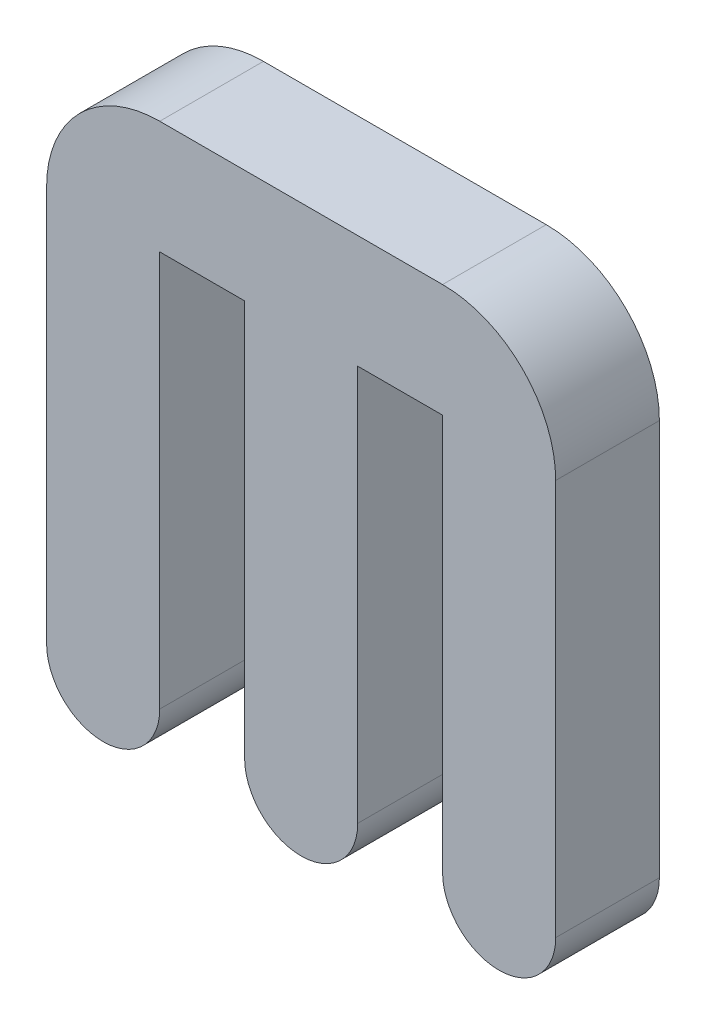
ISO-10303-21;
HEADER;
FILE_DESCRIPTION(('STEP AP214'),'2;1');
FILE_NAME('part.step','',(''),(''),'','','');
FILE_SCHEMA(('AUTOMOTIVE_DESIGN { 1 0 10303 214 1 1 1 1 }'));
ENDSEC;
DATA;
#1=APPLICATION_CONTEXT('core data for automotive mechanical design processes');
#2=APPLICATION_PROTOCOL_DEFINITION('international standard','automotive_design',2000,#1);
#3=PRODUCT_CONTEXT('',#1,'mechanical');
#4=PRODUCT('Part','Part','',(#3));
#5=PRODUCT_RELATED_PRODUCT_CATEGORY('part','',(#4));
#6=PRODUCT_DEFINITION_FORMATION('','',#4);
#7=PRODUCT_DEFINITION_CONTEXT('part definition',#1,'design');
#8=PRODUCT_DEFINITION('design','',#6,#7);
#9=PRODUCT_DEFINITION_SHAPE('','',#8);
#10=(LENGTH_UNIT() NAMED_UNIT(*) SI_UNIT(.MILLI.,.METRE.));
#11=(NAMED_UNIT(*) PLANE_ANGLE_UNIT() SI_UNIT($,.RADIAN.));
#12=(NAMED_UNIT(*) SI_UNIT($,.STERADIAN.) SOLID_ANGLE_UNIT());
#13=UNCERTAINTY_MEASURE_WITH_UNIT(LENGTH_MEASURE(1.E-05),#10,'distance_accuracy_value','');
#14=(GEOMETRIC_REPRESENTATION_CONTEXT(3) GLOBAL_UNCERTAINTY_ASSIGNED_CONTEXT((#13)) GLOBAL_UNIT_ASSIGNED_CONTEXT((#10,
#11,#12)) REPRESENTATION_CONTEXT('',''));
#15=CARTESIAN_POINT('',(0.,0.,0.));
#16=DIRECTION('',(0.,0.,1.));
#17=DIRECTION('',(1.,0.,0.));
#18=AXIS2_PLACEMENT_3D('',#15,#16,#17);
#19=CARTESIAN_POINT('',(-4.0909085,-6.45454400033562,3.));
#20=DIRECTION('',(-1.,0.,0.));
#21=DIRECTION('',(0.,-1.,0.));
#22=AXIS2_PLACEMENT_3D('',#19,#20,#21);
#23=PLANE('',#22);
#24=DIRECTION('',(0.,1.,0.));
#25=VECTOR('',#24,1.);
#26=CARTESIAN_POINT('',(-4.0909085,-6.45454400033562,0.));
#27=LINE('',#26,#25);
#28=CARTESIAN_POINT('',(-4.0909085,-6.45454400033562,0.));
#29=VERTEX_POINT('',#28);
#30=CARTESIAN_POINT('',(-4.0909085,4.999999,0.));
#31=VERTEX_POINT('',#30);
#32=EDGE_CURVE('E203',#29,#31,#27,.T.);
#33=ORIENTED_EDGE('',*,*,#32,.T.);
#34=DIRECTION('',(0.,0.,-1.));
#35=VECTOR('',#34,1.);
#36=CARTESIAN_POINT('',(-4.0909085,4.999999,3.));
#37=LINE('',#36,#35);
#38=CARTESIAN_POINT('',(-4.0909085,4.999999,3.));
#39=VERTEX_POINT('',#38);
#40=EDGE_CURVE('E11',#39,#31,#37,.T.);
#41=ORIENTED_EDGE('',*,*,#40,.F.);
#42=DIRECTION('',(0.,1.,0.));
#43=VECTOR('',#42,1.);
#44=CARTESIAN_POINT('',(-4.0909085,-6.45454400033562,3.));
#45=LINE('',#44,#43);
#46=CARTESIAN_POINT('',(-4.0909085,-6.45454400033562,3.));
#47=VERTEX_POINT('',#46);
#48=EDGE_CURVE('E242',#47,#39,#45,.T.);
#49=ORIENTED_EDGE('',*,*,#48,.F.);
#50=DIRECTION('',(0.,0.,-1.));
#51=VECTOR('',#50,1.);
#52=CARTESIAN_POINT('',(-4.0909085,-6.45454400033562,3.));
#53=LINE('',#52,#51);
#54=EDGE_CURVE('E199',#47,#29,#53,.T.);
#55=ORIENTED_EDGE('',*,*,#54,.T.);
#56=EDGE_LOOP('',(#33,#41,#49,#55));
#57=FACE_BOUND('',#56,.T.);
#58=ADVANCED_FACE('F40',(#57),#23,.F.);
#59=CARTESIAN_POINT('',(-4.0909085,4.999999,3.));
#60=DIRECTION('',(0.,1.,0.));
#61=DIRECTION('',(-1.,0.,0.));
#62=AXIS2_PLACEMENT_3D('',#59,#60,#61);
#63=PLANE('',#62);
#64=DIRECTION('',(1.,0.,0.));
#65=VECTOR('',#64,1.);
#66=CARTESIAN_POINT('',(-4.0909085,4.999999,0.));
#67=LINE('',#66,#65);
#68=CARTESIAN_POINT('',(-1.6363635,4.999999,0.));
#69=VERTEX_POINT('',#68);
#70=EDGE_CURVE('E207',#31,#69,#67,.T.);
#71=ORIENTED_EDGE('',*,*,#70,.T.);
#72=DIRECTION('',(0.,0.,-1.));
#73=VECTOR('',#72,1.);
#74=CARTESIAN_POINT('',(-1.6363635,4.999999,3.));
#75=LINE('',#74,#73);
#76=CARTESIAN_POINT('',(-1.6363635,4.999999,3.));
#77=VERTEX_POINT('',#76);
#78=EDGE_CURVE('E49',#77,#69,#75,.T.);
#79=ORIENTED_EDGE('',*,*,#78,.F.);
#80=DIRECTION('',(1.,0.,0.));
#81=VECTOR('',#80,1.);
#82=CARTESIAN_POINT('',(-4.0909085,4.999999,3.));
#83=LINE('',#82,#81);
#84=EDGE_CURVE('E136',#39,#77,#83,.T.);
#85=ORIENTED_EDGE('',*,*,#84,.F.);
#86=ORIENTED_EDGE('',*,*,#40,.T.);
#87=EDGE_LOOP('',(#71,#79,#85,#86));
#88=FACE_BOUND('',#87,.T.);
#89=ADVANCED_FACE('F332',(#88),#63,.F.);
#90=CARTESIAN_POINT('',(-1.6363635,4.999999,3.));
#91=DIRECTION('',(1.,0.,0.));
#92=DIRECTION('',(0.,1.,0.));
#93=AXIS2_PLACEMENT_3D('',#90,#91,#92);
#94=PLANE('',#93);
#95=DIRECTION('',(0.,-1.,0.));
#96=VECTOR('',#95,1.);
#97=CARTESIAN_POINT('',(-1.6363635,4.999999,0.));
#98=LINE('',#97,#96);
#99=CARTESIAN_POINT('',(-1.6363635,-6.454543,0.));
#100=VERTEX_POINT('',#99);
#101=EDGE_CURVE('E210',#69,#100,#98,.T.);
#102=ORIENTED_EDGE('',*,*,#101,.T.);
#103=DIRECTION('',(0.,0.,-1.));
#104=VECTOR('',#103,1.);
#105=CARTESIAN_POINT('',(-1.6363635,-6.454543,3.));
#106=LINE('',#105,#104);
#107=CARTESIAN_POINT('',(-1.6363635,-6.454543,3.));
#108=VERTEX_POINT('',#107);
#109=EDGE_CURVE('E276',#108,#100,#106,.T.);
#110=ORIENTED_EDGE('',*,*,#109,.F.);
#111=DIRECTION('',(0.,-1.,0.));
#112=VECTOR('',#111,1.);
#113=CARTESIAN_POINT('',(-1.6363635,4.999999,3.));
#114=LINE('',#113,#112);
#115=EDGE_CURVE('E287',#77,#108,#114,.T.);
#116=ORIENTED_EDGE('',*,*,#115,.F.);
#117=ORIENTED_EDGE('',*,*,#78,.T.);
#118=EDGE_LOOP('',(#102,#110,#116,#117));
#119=FACE_BOUND('',#118,.T.);
#120=ADVANCED_FACE('F285',(#119),#94,.F.);
#121=CARTESIAN_POINT('',(0.,-6.454543,3.));
#122=DIRECTION('',(0.,0.,-1.));
#123=DIRECTION('',(-1.,0.,0.));
#124=AXIS2_PLACEMENT_3D('',#121,#122,#123);
#125=CYLINDRICAL_SURFACE('',#124,1.6363635);
#126=CARTESIAN_POINT('',(0.,-6.454543,0.));
#127=DIRECTION('',(0.,0.,1.));
#128=DIRECTION('',(1.,0.,0.));
#129=AXIS2_PLACEMENT_3D('',#126,#127,#128);
#130=CIRCLE('',#129,1.6363635);
#131=CARTESIAN_POINT('',(1.6363635,-6.45454300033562,0.));
#132=VERTEX_POINT('',#131);
#133=EDGE_CURVE('E213',#100,#132,#130,.T.);
#134=ORIENTED_EDGE('',*,*,#133,.T.);
#135=DIRECTION('',(0.,0.,-1.));
#136=VECTOR('',#135,1.);
#137=CARTESIAN_POINT('',(1.6363635,-6.45454300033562,3.));
#138=LINE('',#137,#136);
#139=CARTESIAN_POINT('',(1.6363635,-6.45454300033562,3.));
#140=VERTEX_POINT('',#139);
#141=EDGE_CURVE('E272',#140,#132,#138,.T.);
#142=ORIENTED_EDGE('',*,*,#141,.F.);
#143=CARTESIAN_POINT('',(0.,-6.454543,3.));
#144=DIRECTION('',(0.,0.,1.));
#145=DIRECTION('',(1.,0.,0.));
#146=AXIS2_PLACEMENT_3D('',#143,#144,#145);
#147=CIRCLE('',#146,1.6363635);
#148=EDGE_CURVE('E306',#108,#140,#147,.T.);
#149=ORIENTED_EDGE('',*,*,#148,.F.);
#150=ORIENTED_EDGE('',*,*,#109,.T.);
#151=EDGE_LOOP('',(#134,#142,#149,#150));
#152=FACE_BOUND('',#151,.T.);
#153=ADVANCED_FACE('F296',(#152),#125,.T.);
#154=CARTESIAN_POINT('',(1.6363635,-6.45454300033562,3.));
#155=DIRECTION('',(-1.,0.,0.));
#156=DIRECTION('',(0.,-1.,0.));
#157=AXIS2_PLACEMENT_3D('',#154,#155,#156);
#158=PLANE('',#157);
#159=DIRECTION('',(0.,1.,0.));
#160=VECTOR('',#159,1.);
#161=CARTESIAN_POINT('',(1.6363635,-6.45454300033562,0.));
#162=LINE('',#161,#160);
#163=CARTESIAN_POINT('',(1.6363635,4.999999,0.));
#164=VERTEX_POINT('',#163);
#165=EDGE_CURVE('E216',#132,#164,#162,.T.);
#166=ORIENTED_EDGE('',*,*,#165,.T.);
#167=DIRECTION('',(0.,0.,-1.));
#168=VECTOR('',#167,1.);
#169=CARTESIAN_POINT('',(1.6363635,4.999999,3.));
#170=LINE('',#169,#168);
#171=CARTESIAN_POINT('',(1.6363635,4.999999,3.));
#172=VERTEX_POINT('',#171);
#173=EDGE_CURVE('E268',#172,#164,#170,.T.);
#174=ORIENTED_EDGE('',*,*,#173,.F.);
#175=DIRECTION('',(0.,1.,0.));
#176=VECTOR('',#175,1.);
#177=CARTESIAN_POINT('',(1.6363635,-6.45454300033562,3.));
#178=LINE('',#177,#176);
#179=EDGE_CURVE('E302',#140,#172,#178,.T.);
#180=ORIENTED_EDGE('',*,*,#179,.F.);
#181=ORIENTED_EDGE('',*,*,#141,.T.);
#182=EDGE_LOOP('',(#166,#174,#180,#181));
#183=FACE_BOUND('',#182,.T.);
#184=ADVANCED_FACE('F300',(#183),#158,.F.);
#185=CARTESIAN_POINT('',(1.6363635,4.999999,3.));
#186=DIRECTION('',(0.,1.,0.));
#187=DIRECTION('',(-1.,0.,0.));
#188=AXIS2_PLACEMENT_3D('',#185,#186,#187);
#189=PLANE('',#188);
#190=DIRECTION('',(1.,0.,0.));
#191=VECTOR('',#190,1.);
#192=CARTESIAN_POINT('',(1.6363635,4.999999,0.));
#193=LINE('',#192,#191);
#194=CARTESIAN_POINT('',(4.0909095,4.999999,0.));
#195=VERTEX_POINT('',#194);
#196=EDGE_CURVE('E219',#164,#195,#193,.T.);
#197=ORIENTED_EDGE('',*,*,#196,.T.);
#198=DIRECTION('',(0.,0.,-1.));
#199=VECTOR('',#198,1.);
#200=CARTESIAN_POINT('',(4.0909095,4.999999,3.));
#201=LINE('',#200,#199);
#202=CARTESIAN_POINT('',(4.0909095,4.999999,3.));
#203=VERTEX_POINT('',#202);
#204=EDGE_CURVE('E264',#203,#195,#201,.T.);
#205=ORIENTED_EDGE('',*,*,#204,.F.);
#206=DIRECTION('',(1.,0.,0.));
#207=VECTOR('',#206,1.);
#208=CARTESIAN_POINT('',(1.6363635,4.999999,3.));
#209=LINE('',#208,#207);
#210=EDGE_CURVE('E305',#172,#203,#209,.T.);
#211=ORIENTED_EDGE('',*,*,#210,.F.);
#212=ORIENTED_EDGE('',*,*,#173,.T.);
#213=EDGE_LOOP('',(#197,#205,#211,#212));
#214=FACE_BOUND('',#213,.T.);
#215=ADVANCED_FACE('F344',(#214),#189,.F.);
#216=CARTESIAN_POINT('',(4.0909095,4.999999,3.));
#217=DIRECTION('',(1.,0.,0.));
#218=DIRECTION('',(0.,0.,-1.));
#219=AXIS2_PLACEMENT_3D('',#216,#217,#218);
#220=PLANE('',#219);
#221=DIRECTION('',(0.,-1.,0.));
#222=VECTOR('',#221,1.);
#223=CARTESIAN_POINT('',(4.0909095,4.999999,0.));
#224=LINE('',#223,#222);
#225=CARTESIAN_POINT('',(4.0909095,-6.454547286,0.));
#226=VERTEX_POINT('',#225);
#227=EDGE_CURVE('E222',#195,#226,#224,.T.);
#228=ORIENTED_EDGE('',*,*,#227,.T.);
#229=DIRECTION('',(0.,0.,-1.));
#230=VECTOR('',#229,1.);
#231=CARTESIAN_POINT('',(4.0909095,-6.454547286,3.));
#232=LINE('',#231,#230);
#233=CARTESIAN_POINT('',(4.0909095,-6.454547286,3.));
#234=VERTEX_POINT('',#233);
#235=EDGE_CURVE('E260',#234,#226,#232,.T.);
#236=ORIENTED_EDGE('',*,*,#235,.F.);
#237=DIRECTION('',(0.,-1.,0.));
#238=VECTOR('',#237,1.);
#239=CARTESIAN_POINT('',(4.0909095,4.999999,3.));
#240=LINE('',#239,#238);
#241=EDGE_CURVE('E310',#203,#234,#240,.T.);
#242=ORIENTED_EDGE('',*,*,#241,.F.);
#243=ORIENTED_EDGE('',*,*,#204,.T.);
#244=EDGE_LOOP('',(#228,#236,#242,#243));
#245=FACE_BOUND('',#244,.T.);
#246=ADVANCED_FACE('F347',(#245),#220,.F.);
#247=CARTESIAN_POINT('',(5.727273,-6.454547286,3.));
#248=DIRECTION('',(0.,0.,-1.));
#249=DIRECTION('',(-1.,0.,0.));
#250=AXIS2_PLACEMENT_3D('',#247,#248,#249);
#251=CYLINDRICAL_SURFACE('',#250,1.6363635);
#252=CARTESIAN_POINT('',(5.727273,-6.454547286,0.));
#253=DIRECTION('',(0.,0.,1.));
#254=DIRECTION('',(1.,0.,0.));
#255=AXIS2_PLACEMENT_3D('',#252,#253,#254);
#256=CIRCLE('',#255,1.6363635);
#257=CARTESIAN_POINT('',(7.3636365,-6.45454728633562,0.));
#258=VERTEX_POINT('',#257);
#259=EDGE_CURVE('E225',#226,#258,#256,.T.);
#260=ORIENTED_EDGE('',*,*,#259,.T.);
#261=DIRECTION('',(0.,0.,-1.));
#262=VECTOR('',#261,1.);
#263=CARTESIAN_POINT('',(7.3636365,-6.45454728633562,3.));
#264=LINE('',#263,#262);
#265=CARTESIAN_POINT('',(7.3636365,-6.45454728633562,3.));
#266=VERTEX_POINT('',#265);
#267=EDGE_CURVE('E256',#266,#258,#264,.T.);
#268=ORIENTED_EDGE('',*,*,#267,.F.);
#269=CARTESIAN_POINT('',(5.727273,-6.454547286,3.));
#270=DIRECTION('',(0.,0.,1.));
#271=DIRECTION('',(1.,0.,0.));
#272=AXIS2_PLACEMENT_3D('',#269,#270,#271);
#273=CIRCLE('',#272,1.6363635);
#274=EDGE_CURVE('E317',#234,#266,#273,.T.);
#275=ORIENTED_EDGE('',*,*,#274,.F.);
#276=ORIENTED_EDGE('',*,*,#235,.T.);
#277=EDGE_LOOP('',(#260,#268,#275,#276));
#278=FACE_BOUND('',#277,.T.);
#279=ADVANCED_FACE('F351',(#278),#251,.T.);
#280=CARTESIAN_POINT('',(7.3636365,-6.45454728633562,3.));
#281=DIRECTION('',(-1.,0.,0.));
#282=DIRECTION('',(0.,-1.,0.));
#283=AXIS2_PLACEMENT_3D('',#280,#281,#282);
#284=PLANE('',#283);
#285=DIRECTION('',(0.,1.,0.));
#286=VECTOR('',#285,1.);
#287=CARTESIAN_POINT('',(7.3636365,-6.45454728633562,0.));
#288=LINE('',#287,#286);
#289=CARTESIAN_POINT('',(7.3636365,4.99999899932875,0.));
#290=VERTEX_POINT('',#289);
#291=EDGE_CURVE('E228',#258,#290,#288,.T.);
#292=ORIENTED_EDGE('',*,*,#291,.T.);
#293=DIRECTION('',(0.,0.,-1.));
#294=VECTOR('',#293,1.);
#295=CARTESIAN_POINT('',(7.3636365,4.99999899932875,3.));
#296=LINE('',#295,#294);
#297=CARTESIAN_POINT('',(7.3636365,4.99999899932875,3.));
#298=VERTEX_POINT('',#297);
#299=EDGE_CURVE('E252',#298,#290,#296,.T.);
#300=ORIENTED_EDGE('',*,*,#299,.F.);
#301=DIRECTION('',(0.,1.,0.));
#302=VECTOR('',#301,1.);
#303=CARTESIAN_POINT('',(7.3636365,-6.45454728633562,3.));
#304=LINE('',#303,#302);
#305=EDGE_CURVE('E320',#266,#298,#304,.T.);
#306=ORIENTED_EDGE('',*,*,#305,.F.);
#307=ORIENTED_EDGE('',*,*,#267,.T.);
#308=EDGE_LOOP('',(#292,#300,#306,#307));
#309=FACE_BOUND('',#308,.T.);
#310=ADVANCED_FACE('F355',(#309),#284,.F.);
#311=CARTESIAN_POINT('',(4.0909095,4.999999,3.));
#312=DIRECTION('',(0.,0.,-1.));
#313=DIRECTION('',(-1.,0.,0.));
#314=AXIS2_PLACEMENT_3D('',#311,#312,#313);
#315=CYLINDRICAL_SURFACE('',#314,3.272727);
#316=CARTESIAN_POINT('',(4.0909095,4.999999,0.));
#317=DIRECTION('',(0.,0.,1.));
#318=DIRECTION('',(1.,0.,0.));
#319=AXIS2_PLACEMENT_3D('',#316,#317,#318);
#320=CIRCLE('',#319,3.272727);
#321=CARTESIAN_POINT('',(4.09090950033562,8.272726,0.));
#322=VERTEX_POINT('',#321);
#323=EDGE_CURVE('E231',#290,#322,#320,.T.);
#324=ORIENTED_EDGE('',*,*,#323,.T.);
#325=DIRECTION('',(0.,0.,-1.));
#326=VECTOR('',#325,1.);
#327=CARTESIAN_POINT('',(4.09090950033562,8.272726,3.));
#328=LINE('',#327,#326);
#329=CARTESIAN_POINT('',(4.09090950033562,8.272726,3.));
#330=VERTEX_POINT('',#329);
#331=EDGE_CURVE('E249',#330,#322,#328,.T.);
#332=ORIENTED_EDGE('',*,*,#331,.F.);
#333=CARTESIAN_POINT('',(4.0909095,4.999999,3.));
#334=DIRECTION('',(0.,0.,1.));
#335=DIRECTION('',(1.,0.,0.));
#336=AXIS2_PLACEMENT_3D('',#333,#334,#335);
#337=CIRCLE('',#336,3.272727);
#338=EDGE_CURVE('E323',#298,#330,#337,.T.);
#339=ORIENTED_EDGE('',*,*,#338,.F.);
#340=ORIENTED_EDGE('',*,*,#299,.T.);
#341=EDGE_LOOP('',(#324,#332,#339,#340));
#342=FACE_BOUND('',#341,.T.);
#343=ADVANCED_FACE('F359',(#342),#315,.T.);
#344=CARTESIAN_POINT('',(4.09090950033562,8.272726,3.));
#345=DIRECTION('',(0.,-1.,0.));
#346=DIRECTION('',(0.,0.,-1.));
#347=AXIS2_PLACEMENT_3D('',#344,#345,#346);
#348=PLANE('',#347);
#349=DIRECTION('',(-1.,0.,0.));
#350=VECTOR('',#349,1.);
#351=CARTESIAN_POINT('',(4.09090950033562,8.272726,0.));
#352=LINE('',#351,#350);
#353=CARTESIAN_POINT('',(-4.0909085,8.272726,0.));
#354=VERTEX_POINT('',#353);
#355=EDGE_CURVE('E234',#322,#354,#352,.T.);
#356=ORIENTED_EDGE('',*,*,#355,.T.);
#357=DIRECTION('',(0.,0.,-1.));
#358=VECTOR('',#357,1.);
#359=CARTESIAN_POINT('',(-4.0909085,8.272726,3.));
#360=LINE('',#359,#358);
#361=CARTESIAN_POINT('',(-4.0909085,8.272726,3.));
#362=VERTEX_POINT('',#361);
#363=EDGE_CURVE('E191',#362,#354,#360,.T.);
#364=ORIENTED_EDGE('',*,*,#363,.F.);
#365=DIRECTION('',(-1.,0.,0.));
#366=VECTOR('',#365,1.);
#367=CARTESIAN_POINT('',(4.09090950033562,8.272726,3.));
#368=LINE('',#367,#366);
#369=EDGE_CURVE('E180',#330,#362,#368,.T.);
#370=ORIENTED_EDGE('',*,*,#369,.F.);
#371=ORIENTED_EDGE('',*,*,#331,.T.);
#372=EDGE_LOOP('',(#356,#364,#370,#371));
#373=FACE_BOUND('',#372,.T.);
#374=ADVANCED_FACE('F363',(#373),#348,.F.);
#375=CARTESIAN_POINT('',(-4.0909085,4.999999,3.));
#376=DIRECTION('',(0.,0.,-1.));
#377=DIRECTION('',(-1.,0.,0.));
#378=AXIS2_PLACEMENT_3D('',#375,#376,#377);
#379=CYLINDRICAL_SURFACE('',#378,3.272727);
#380=CARTESIAN_POINT('',(-4.0909085,4.999999,0.));
#381=DIRECTION('',(0.,0.,1.));
#382=DIRECTION('',(1.,0.,0.));
#383=AXIS2_PLACEMENT_3D('',#380,#381,#382);
#384=CIRCLE('',#383,3.272727);
#385=CARTESIAN_POINT('',(-7.3636355,4.999999,0.));
#386=VERTEX_POINT('',#385);
#387=EDGE_CURVE('E189',#354,#386,#384,.T.);
#388=ORIENTED_EDGE('',*,*,#387,.T.);
#389=DIRECTION('',(0.,0.,-1.));
#390=VECTOR('',#389,1.);
#391=CARTESIAN_POINT('',(-7.3636355,4.999999,3.));
#392=LINE('',#391,#390);
#393=CARTESIAN_POINT('',(-7.3636355,4.999999,3.));
#394=VERTEX_POINT('',#393);
#395=EDGE_CURVE('E186',#394,#386,#392,.T.);
#396=ORIENTED_EDGE('',*,*,#395,.F.);
#397=CARTESIAN_POINT('',(-4.0909085,4.999999,3.));
#398=DIRECTION('',(0.,0.,1.));
#399=DIRECTION('',(1.,0.,0.));
#400=AXIS2_PLACEMENT_3D('',#397,#398,#399);
#401=CIRCLE('',#400,3.272727);
#402=EDGE_CURVE('E174',#362,#394,#401,.T.);
#403=ORIENTED_EDGE('',*,*,#402,.F.);
#404=ORIENTED_EDGE('',*,*,#363,.T.);
#405=EDGE_LOOP('',(#388,#396,#403,#404));
#406=FACE_BOUND('',#405,.T.);
#407=ADVANCED_FACE('F187',(#406),#379,.T.);
#408=CARTESIAN_POINT('',(-7.3636355,4.999999,3.));
#409=DIRECTION('',(1.,0.,0.));
#410=DIRECTION('',(0.,0.,-1.));
#411=AXIS2_PLACEMENT_3D('',#408,#409,#410);
#412=PLANE('',#411);
#413=DIRECTION('',(0.,-1.,0.));
#414=VECTOR('',#413,1.);
#415=CARTESIAN_POINT('',(-7.3636355,4.999999,0.));
#416=LINE('',#415,#414);
#417=CARTESIAN_POINT('',(-7.3636355,-6.454544,0.));
#418=VERTEX_POINT('',#417);
#419=EDGE_CURVE('E119',#386,#418,#416,.T.);
#420=ORIENTED_EDGE('',*,*,#419,.T.);
#421=DIRECTION('',(0.,0.,-1.));
#422=VECTOR('',#421,1.);
#423=CARTESIAN_POINT('',(-7.3636355,-6.454544,3.));
#424=LINE('',#423,#422);
#425=CARTESIAN_POINT('',(-7.3636355,-6.454544,3.));
#426=VERTEX_POINT('',#425);
#427=EDGE_CURVE('E192',#426,#418,#424,.T.);
#428=ORIENTED_EDGE('',*,*,#427,.F.);
#429=DIRECTION('',(0.,-1.,0.));
#430=VECTOR('',#429,1.);
#431=CARTESIAN_POINT('',(-7.3636355,4.999999,3.));
#432=LINE('',#431,#430);
#433=EDGE_CURVE('E178',#394,#426,#432,.T.);
#434=ORIENTED_EDGE('',*,*,#433,.F.);
#435=ORIENTED_EDGE('',*,*,#395,.T.);
#436=EDGE_LOOP('',(#420,#428,#434,#435));
#437=FACE_BOUND('',#436,.T.);
#438=ADVANCED_FACE('F194',(#437),#412,.F.);
#439=CARTESIAN_POINT('',(-5.727272,-6.454544,3.));
#440=DIRECTION('',(0.,0.,-1.));
#441=DIRECTION('',(-1.,0.,0.));
#442=AXIS2_PLACEMENT_3D('',#439,#440,#441);
#443=CYLINDRICAL_SURFACE('',#442,1.6363635);
#444=CARTESIAN_POINT('',(-5.727272,-6.454544,0.));
#445=DIRECTION('',(0.,0.,1.));
#446=DIRECTION('',(1.,0.,0.));
#447=AXIS2_PLACEMENT_3D('',#444,#445,#446);
#448=CIRCLE('',#447,1.6363635);
#449=EDGE_CURVE('E125',#418,#29,#448,.T.);
#450=ORIENTED_EDGE('',*,*,#449,.T.);
#451=ORIENTED_EDGE('',*,*,#54,.F.);
#452=CARTESIAN_POINT('',(-5.727272,-6.454544,3.));
#453=DIRECTION('',(0.,0.,1.));
#454=DIRECTION('',(1.,0.,0.));
#455=AXIS2_PLACEMENT_3D('',#452,#453,#454);
#456=CIRCLE('',#455,1.6363635);
#457=EDGE_CURVE('E60',#426,#47,#456,.T.);
#458=ORIENTED_EDGE('',*,*,#457,.F.);
#459=ORIENTED_EDGE('',*,*,#427,.T.);
#460=EDGE_LOOP('',(#450,#451,#458,#459));
#461=FACE_BOUND('',#460,.T.);
#462=ADVANCED_FACE('F372',(#461),#443,.T.);
#463=CARTESIAN_POINT('',(0.,-6.454543,3.));
#464=DIRECTION('',(0.,0.,1.));
#465=DIRECTION('',(1.,0.,0.));
#466=AXIS2_PLACEMENT_3D('',#463,#464,#465);
#467=PLANE('',#466);
#468=ORIENTED_EDGE('',*,*,#48,.T.);
#469=ORIENTED_EDGE('',*,*,#84,.T.);
#470=ORIENTED_EDGE('',*,*,#115,.T.);
#471=ORIENTED_EDGE('',*,*,#148,.T.);
#472=ORIENTED_EDGE('',*,*,#179,.T.);
#473=ORIENTED_EDGE('',*,*,#210,.T.);
#474=ORIENTED_EDGE('',*,*,#241,.T.);
#475=ORIENTED_EDGE('',*,*,#274,.T.);
#476=ORIENTED_EDGE('',*,*,#305,.T.);
#477=ORIENTED_EDGE('',*,*,#338,.T.);
#478=ORIENTED_EDGE('',*,*,#369,.T.);
#479=ORIENTED_EDGE('',*,*,#402,.T.);
#480=ORIENTED_EDGE('',*,*,#433,.T.);
#481=ORIENTED_EDGE('',*,*,#457,.T.);
#482=EDGE_LOOP('',(#468,#469,#470,#471,#472,#473,#474,#475,#476,#477,#478,#479,#480,#481));
#483=FACE_BOUND('',#482,.T.);
#484=ADVANCED_FACE('F176',(#483),#467,.T.);
#485=CARTESIAN_POINT('',(0.,-6.454543,0.));
#486=DIRECTION('',(0.,0.,1.));
#487=DIRECTION('',(1.,0.,0.));
#488=AXIS2_PLACEMENT_3D('',#485,#486,#487);
#489=PLANE('',#488);
#490=ORIENTED_EDGE('',*,*,#32,.F.);
#491=ORIENTED_EDGE('',*,*,#449,.F.);
#492=ORIENTED_EDGE('',*,*,#419,.F.);
#493=ORIENTED_EDGE('',*,*,#387,.F.);
#494=ORIENTED_EDGE('',*,*,#355,.F.);
#495=ORIENTED_EDGE('',*,*,#323,.F.);
#496=ORIENTED_EDGE('',*,*,#291,.F.);
#497=ORIENTED_EDGE('',*,*,#259,.F.);
#498=ORIENTED_EDGE('',*,*,#227,.F.);
#499=ORIENTED_EDGE('',*,*,#196,.F.);
#500=ORIENTED_EDGE('',*,*,#165,.F.);
#501=ORIENTED_EDGE('',*,*,#133,.F.);
#502=ORIENTED_EDGE('',*,*,#101,.F.);
#503=ORIENTED_EDGE('',*,*,#70,.F.);
#504=EDGE_LOOP('',(#490,#491,#492,#493,#494,#495,#496,#497,#498,#499,#500,#501,#502,#503));
#505=FACE_BOUND('',#504,.T.);
#506=ADVANCED_FACE('F291',(#505),#489,.F.);
#507=CLOSED_SHELL('',(#58,#89,#120,#153,#184,#215,#246,#279,#310,#343,#374,#407,#438,#462,#484,#506));
#508=MANIFOLD_SOLID_BREP('B2',#507);
#509=ADVANCED_BREP_SHAPE_REPRESENTATION('',(#18,#508),#14);
#510=SHAPE_DEFINITION_REPRESENTATION(#9,#509);
ENDSEC;
END-ISO-10303-21;
